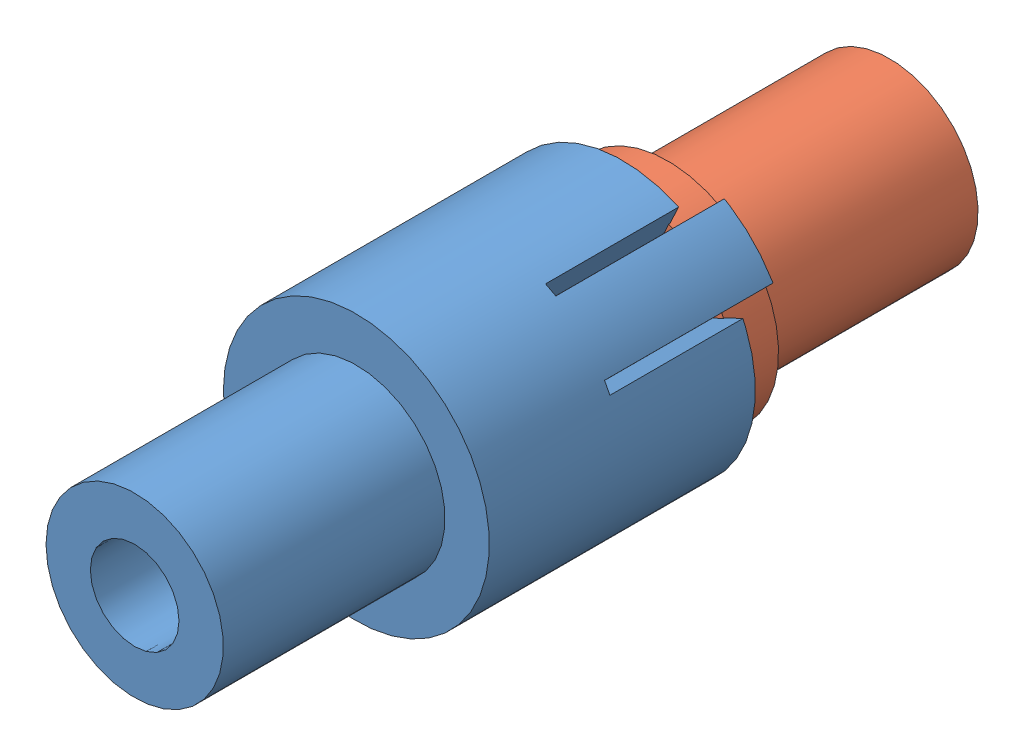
SolidWorks assembly AnnularSnapFitAssembly.SLDASM, configuration Default (file format 11000). Lengths in mm.
Overall size (15.24 15.24 43.11).
2 component instances, 2 part files, 0 mates.
Components (placement in the parent):
- FemaleAnnularConnector-1: FemaleAnnularConnector.SLDPRT [Default] at (0.7922 13.0519 30.2507) size (15.24 15.24 29.97)
- MaleAnnularConnector-1: MaleAnnularConnector.SLDPRT [Default] at (8.2405 6.6608 4.5477) x (0 0 1) z (0 1 0) size (27.94 12.7 12.7)
